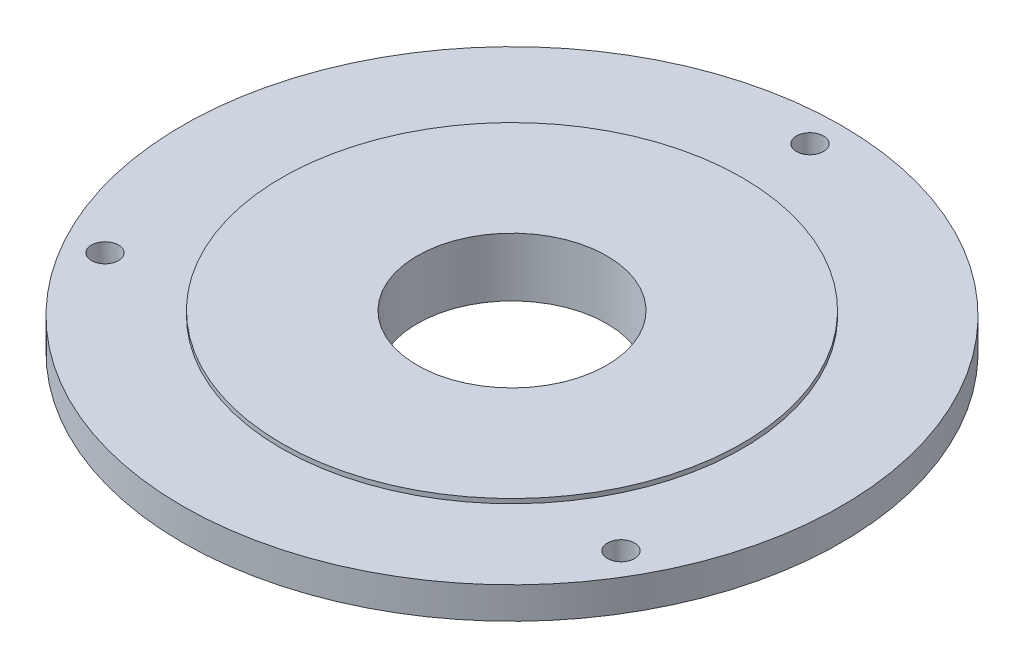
from build123d import *

# Parameters (mm, degrees)
SCHIZZO2_R               = 1.5
TAGLIO_ESTRUSIONE1_DEPTH = 52.966335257


with BuildPart() as part:
    # Schizzo1 → Rivoluzione1 (revolve)
    with BuildSketch(Plane.XY, mode=Mode.PRIVATE) as rivoluzione1_sk:
        Polygon((36.5, 37.885931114), (36.5, 34.385931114), (14.25, 34.385931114), (14.25, 31.885931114), (10.5, 31.885931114), (10.5, 38.385931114), (25.5, 38.385931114), (25.5, 37.885931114), align=None)
    revolve(rivoluzione1_sk.sketch.rotate(Axis((0, 0, 0), (0, 1, 0)), 90), axis=Axis((0, 0, 0), (0, 1, 0)))

    # Schizzo2 → Taglio-Estrusione1 (cut, through all)
    with BuildSketch(Plane(origin=(0, 37.885931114, 0), x_dir=(1, 0, 0), z_dir=(0, 1, 0))):
        with Locations(Location((0, 33, 0), (0, 0, 270))):
            Circle(SCHIZZO2_R)
        with Locations(Location((28.578838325, -16.5, 0), (0, 0, 270))):
            Circle(SCHIZZO2_R)
        with Locations(Location((-28.578838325, -16.5, 0), (0, 0, 270))):
            Circle(SCHIZZO2_R)
    extrude(amount=-TAGLIO_ESTRUSIONE1_DEPTH, mode=Mode.SUBTRACT)


solid = part.part
